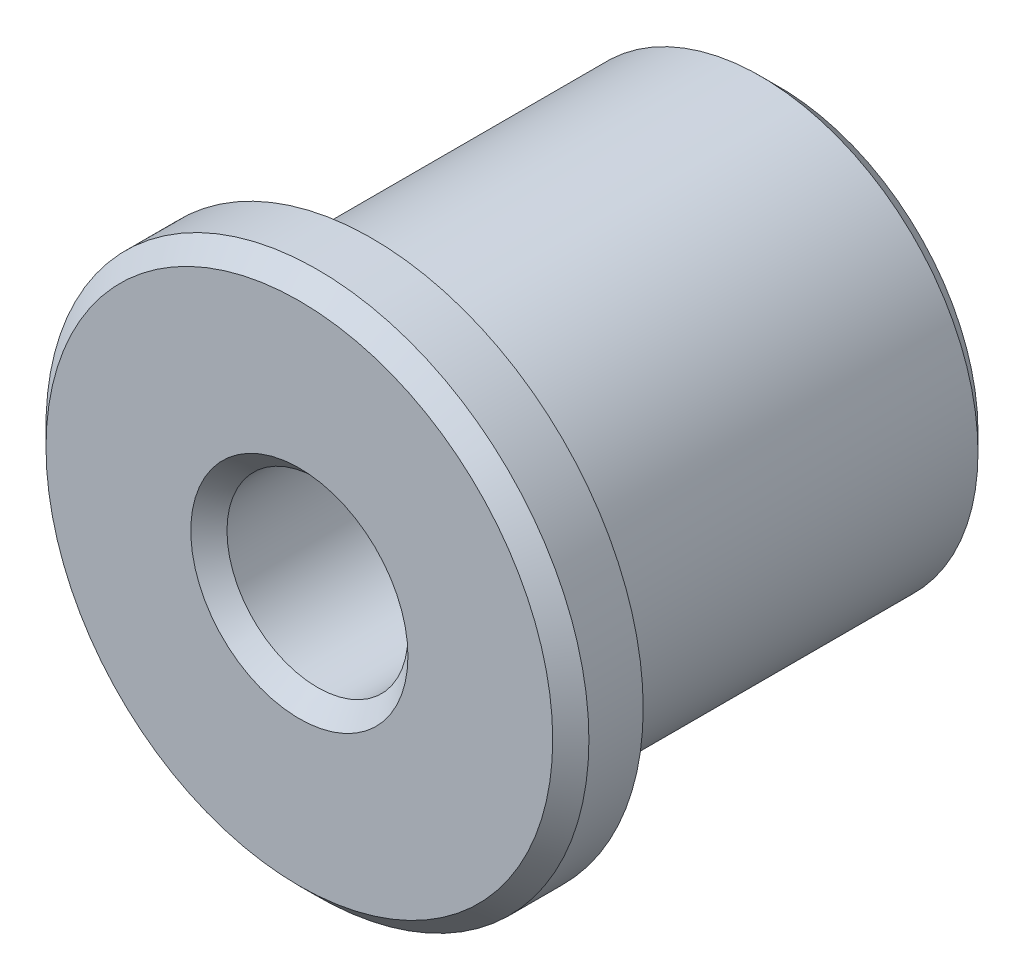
ISO-10303-21;
HEADER;
FILE_DESCRIPTION(('STEP AP214'),'2;1');
FILE_NAME('part.step','',(''),(''),'','','');
FILE_SCHEMA(('AUTOMOTIVE_DESIGN { 1 0 10303 214 1 1 1 1 }'));
ENDSEC;
DATA;
#1=APPLICATION_CONTEXT('core data for automotive mechanical design processes');
#2=APPLICATION_PROTOCOL_DEFINITION('international standard','automotive_design',2000,#1);
#3=PRODUCT_CONTEXT('',#1,'mechanical');
#4=PRODUCT('Part','Part','',(#3));
#5=PRODUCT_RELATED_PRODUCT_CATEGORY('part','',(#4));
#6=PRODUCT_DEFINITION_FORMATION('','',#4);
#7=PRODUCT_DEFINITION_CONTEXT('part definition',#1,'design');
#8=PRODUCT_DEFINITION('design','',#6,#7);
#9=PRODUCT_DEFINITION_SHAPE('','',#8);
#10=(LENGTH_UNIT() NAMED_UNIT(*) SI_UNIT(.MILLI.,.METRE.));
#11=(NAMED_UNIT(*) PLANE_ANGLE_UNIT() SI_UNIT($,.RADIAN.));
#12=(NAMED_UNIT(*) SI_UNIT($,.STERADIAN.) SOLID_ANGLE_UNIT());
#13=UNCERTAINTY_MEASURE_WITH_UNIT(LENGTH_MEASURE(1.E-05),#10,'distance_accuracy_value','');
#14=(GEOMETRIC_REPRESENTATION_CONTEXT(3) GLOBAL_UNCERTAINTY_ASSIGNED_CONTEXT((#13)) GLOBAL_UNIT_ASSIGNED_CONTEXT((#10,
#11,#12)) REPRESENTATION_CONTEXT('',''));
#15=CARTESIAN_POINT('',(0.,0.,0.));
#16=DIRECTION('',(0.,0.,1.));
#17=DIRECTION('',(1.,0.,0.));
#18=AXIS2_PLACEMENT_3D('',#15,#16,#17);
#19=CARTESIAN_POINT('',(0.,0.,0.));
#20=DIRECTION('',(0.,0.,1.));
#21=DIRECTION('',(1.,0.,0.));
#22=AXIS2_PLACEMENT_3D('',#19,#20,#21);
#23=PLANE('',#22);
#24=CARTESIAN_POINT('',(0.,0.,0.));
#25=DIRECTION('',(0.,0.,1.));
#26=DIRECTION('',(1.,0.,0.));
#27=AXIS2_PLACEMENT_3D('',#24,#25,#26);
#28=CIRCLE('',#27,5.99999999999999);
#29=CARTESIAN_POINT('',(5.99999999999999,0.,0.));
#30=VERTEX_POINT('',#29);
#31=EDGE_CURVE('E37',#30,#30,#28,.T.);
#32=ORIENTED_EDGE('',*,*,#31,.T.);
#33=EDGE_LOOP('',(#32));
#34=FACE_BOUND('',#33,.T.);
#35=CARTESIAN_POINT('',(0.,0.,0.));
#36=DIRECTION('',(0.,0.,1.));
#37=DIRECTION('',(1.,0.,0.));
#38=AXIS2_PLACEMENT_3D('',#35,#36,#37);
#39=CIRCLE('',#38,11.);
#40=CARTESIAN_POINT('',(11.,0.,0.));
#41=VERTEX_POINT('',#40);
#42=EDGE_CURVE('E41',#41,#41,#39,.F.);
#43=ORIENTED_EDGE('',*,*,#42,.T.);
#44=EDGE_LOOP('',(#43));
#45=FACE_BOUND('',#44,.T.);
#46=ADVANCED_FACE('F30',(#34,#45),#23,.F.);
#47=CARTESIAN_POINT('',(0.,0.,22.5));
#48=DIRECTION('',(0.,0.,-1.));
#49=DIRECTION('',(-1.,0.,0.));
#50=AXIS2_PLACEMENT_3D('',#47,#48,#49);
#51=CYLINDRICAL_SURFACE('',#50,12.);
#52=CARTESIAN_POINT('',(0.,0.,1.00000000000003));
#53=DIRECTION('',(0.,0.,1.));
#54=DIRECTION('',(1.,0.,0.));
#55=AXIS2_PLACEMENT_3D('',#52,#53,#54);
#56=CIRCLE('',#55,12.);
#57=CARTESIAN_POINT('',(-12.,0.,1.00000000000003));
#58=VERTEX_POINT('',#57);
#59=EDGE_CURVE('E10',#58,#58,#56,.T.);
#60=CARTESIAN_POINT('',(0.,0.,22.5));
#61=DIRECTION('',(0.,0.,1.));
#62=DIRECTION('',(1.,0.,0.));
#63=AXIS2_PLACEMENT_3D('',#60,#61,#62);
#64=CIRCLE('',#63,12.);
#65=CARTESIAN_POINT('',(-12.,0.,22.5));
#66=VERTEX_POINT('',#65);
#67=EDGE_CURVE('E62',#66,#66,#64,.T.);
#68=CARTESIAN_POINT('',(-12.,0.,1.00000000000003));
#69=CARTESIAN_POINT('',(-12.,0.,1.22395833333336));
#70=CARTESIAN_POINT('',(-12.,0.,1.44791666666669));
#71=CARTESIAN_POINT('',(-12.,0.,1.89583333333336));
#72=CARTESIAN_POINT('',(-12.,0.,2.11979166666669));
#73=CARTESIAN_POINT('',(-12.,0.,2.56770833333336));
#74=CARTESIAN_POINT('',(-12.,0.,2.79166666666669));
#75=CARTESIAN_POINT('',(-12.,0.,3.23958333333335));
#76=CARTESIAN_POINT('',(-12.,0.,3.46354166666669));
#77=CARTESIAN_POINT('',(-12.,0.,3.91145833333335));
#78=CARTESIAN_POINT('',(-12.,0.,4.13541666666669));
#79=CARTESIAN_POINT('',(-12.,0.,4.58333333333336));
#80=CARTESIAN_POINT('',(-12.,0.,4.80729166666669));
#81=CARTESIAN_POINT('',(-12.,0.,5.25520833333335));
#82=CARTESIAN_POINT('',(-12.,0.,5.47916666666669));
#83=CARTESIAN_POINT('',(-12.,0.,5.92708333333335));
#84=CARTESIAN_POINT('',(-12.,0.,6.15104166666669));
#85=CARTESIAN_POINT('',(-12.,0.,6.59895833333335));
#86=CARTESIAN_POINT('',(-12.,0.,6.82291666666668));
#87=CARTESIAN_POINT('',(-12.,0.,7.27083333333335));
#88=CARTESIAN_POINT('',(-12.,0.,7.49479166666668));
#89=CARTESIAN_POINT('',(-12.,0.,7.94270833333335));
#90=CARTESIAN_POINT('',(-12.,0.,8.16666666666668));
#91=CARTESIAN_POINT('',(-12.,0.,8.61458333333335));
#92=CARTESIAN_POINT('',(-12.,0.,8.83854166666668));
#93=CARTESIAN_POINT('',(-12.,0.,9.28645833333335));
#94=CARTESIAN_POINT('',(-12.,0.,9.51041666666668));
#95=CARTESIAN_POINT('',(-12.,0.,9.95833333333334));
#96=CARTESIAN_POINT('',(-12.,0.,10.1822916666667));
#97=CARTESIAN_POINT('',(-12.,0.,10.6302083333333));
#98=CARTESIAN_POINT('',(-12.,0.,10.8541666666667));
#99=CARTESIAN_POINT('',(-12.,0.,11.3020833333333));
#100=CARTESIAN_POINT('',(-12.,0.,11.5260416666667));
#101=CARTESIAN_POINT('',(-12.,0.,11.9739583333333));
#102=CARTESIAN_POINT('',(-12.,0.,12.1979166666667));
#103=CARTESIAN_POINT('',(-12.,0.,12.6458333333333));
#104=CARTESIAN_POINT('',(-12.,0.,12.8697916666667));
#105=CARTESIAN_POINT('',(-12.,0.,13.3177083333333));
#106=CARTESIAN_POINT('',(-12.,0.,13.5416666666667));
#107=CARTESIAN_POINT('',(-12.,0.,13.9895833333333));
#108=CARTESIAN_POINT('',(-12.,0.,14.2135416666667));
#109=CARTESIAN_POINT('',(-12.,0.,14.6614583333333));
#110=CARTESIAN_POINT('',(-12.,0.,14.8854166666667));
#111=CARTESIAN_POINT('',(-12.,0.,15.3333333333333));
#112=CARTESIAN_POINT('',(-12.,0.,15.5572916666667));
#113=CARTESIAN_POINT('',(-12.,0.,16.0052083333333));
#114=CARTESIAN_POINT('',(-12.,0.,16.2291666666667));
#115=CARTESIAN_POINT('',(-12.,0.,16.6770833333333));
#116=CARTESIAN_POINT('',(-12.,0.,16.9010416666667));
#117=CARTESIAN_POINT('',(-12.,0.,17.3489583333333));
#118=CARTESIAN_POINT('',(-12.,0.,17.5729166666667));
#119=CARTESIAN_POINT('',(-12.,0.,18.0208333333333));
#120=CARTESIAN_POINT('',(-12.,0.,18.2447916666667));
#121=CARTESIAN_POINT('',(-12.,0.,18.6927083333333));
#122=CARTESIAN_POINT('',(-12.,0.,18.9166666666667));
#123=CARTESIAN_POINT('',(-12.,0.,19.3645833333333));
#124=CARTESIAN_POINT('',(-12.,0.,19.5885416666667));
#125=CARTESIAN_POINT('',(-12.,0.,20.0364583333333));
#126=CARTESIAN_POINT('',(-12.,0.,20.2604166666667));
#127=CARTESIAN_POINT('',(-12.,0.,20.7083333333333));
#128=CARTESIAN_POINT('',(-12.,0.,20.9322916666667));
#129=CARTESIAN_POINT('',(-12.,0.,21.3802083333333));
#130=CARTESIAN_POINT('',(-12.,0.,21.6041666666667));
#131=CARTESIAN_POINT('',(-12.,0.,22.0520833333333));
#132=CARTESIAN_POINT('',(-12.,0.,22.2760416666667));
#133=CARTESIAN_POINT('',(-12.,0.,22.5));
#134=B_SPLINE_CURVE_WITH_KNOTS('',3,(#68,#69,#70,#71,#72,#73,#74,#75,#76,#77,#78,#79,#80,#81,
#82,#83,#84,#85,#86,#87,#88,#89,#90,#91,#92,#93,#94,#95,#96,#97,#98,#99,#100,#101,#102,#103,
#104,#105,#106,#107,#108,#109,#110,#111,#112,#113,#114,#115,#116,#117,#118,#119,#120,#121,#122,
#123,#124,#125,#126,#127,#128,#129,#130,#131,#132,#133),.UNSPECIFIED.,.F.,.F.,(4,2,2,2,2,2,2,2,
2,2,2,2,2,2,2,2,2,2,2,2,2,2,2,2,2,2,2,2,2,2,2,2,4),(0.,0.671874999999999,1.34375,2.015625,
2.6875,3.359375,4.03124999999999,4.703125,5.37499999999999,6.04687499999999,6.71874999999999,
7.39062499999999,8.06249999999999,8.73437499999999,9.40624999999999,10.078125,10.75,11.421875,
12.09375,12.765625,13.4375,14.109375,14.78125,15.453125,16.125,16.796875,17.46875,18.140625,
18.8125,19.484375,20.15625,20.828125,21.5),.UNSPECIFIED.);
#135=EDGE_CURVE('BSEAM79',#58,#66,#134,.T.);
#136=ORIENTED_EDGE('',*,*,#59,.T.);
#137=ORIENTED_EDGE('',*,*,#67,.F.);
#138=ORIENTED_EDGE('',*,*,#135,.T.);
#139=ORIENTED_EDGE('',*,*,#135,.F.);
#140=EDGE_LOOP('',(#136,#138,#137,#139));
#141=FACE_BOUND('',#140,.T.);
#142=ADVANCED_FACE('F79',(#141),#51,.T.);
#143=CARTESIAN_POINT('',(0.,0.,22.5));
#144=DIRECTION('',(0.,0.,-1.));
#145=DIRECTION('',(-1.,0.,0.));
#146=AXIS2_PLACEMENT_3D('',#143,#144,#145);
#147=CYLINDRICAL_SURFACE('',#146,5.);
#148=CARTESIAN_POINT('',(0.,0.,25.5));
#149=DIRECTION('',(0.,0.,1.));
#150=DIRECTION('',(1.,0.,0.));
#151=AXIS2_PLACEMENT_3D('',#148,#149,#150);
#152=CIRCLE('',#151,5.);
#153=CARTESIAN_POINT('',(-5.,0.,25.5));
#154=VERTEX_POINT('',#153);
#155=EDGE_CURVE('E56',#154,#154,#152,.T.);
#156=CARTESIAN_POINT('',(0.,0.,0.999999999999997));
#157=DIRECTION('',(0.,0.,1.));
#158=DIRECTION('',(1.,0.,0.));
#159=AXIS2_PLACEMENT_3D('',#156,#157,#158);
#160=CIRCLE('',#159,5.);
#161=CARTESIAN_POINT('',(-5.,0.,0.999999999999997));
#162=VERTEX_POINT('',#161);
#163=EDGE_CURVE('E59',#162,#162,#160,.F.);
#164=CARTESIAN_POINT('',(-5.,0.,25.5));
#165=CARTESIAN_POINT('',(-5.,0.,25.2447916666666));
#166=CARTESIAN_POINT('',(-5.,0.,24.9895833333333));
#167=CARTESIAN_POINT('',(-5.,0.,24.4791666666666));
#168=CARTESIAN_POINT('',(-5.,0.,24.2239583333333));
#169=CARTESIAN_POINT('',(-5.,0.,23.7135416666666));
#170=CARTESIAN_POINT('',(-5.,0.,23.4583333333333));
#171=CARTESIAN_POINT('',(-5.,0.,22.9479166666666));
#172=CARTESIAN_POINT('',(-5.,0.,22.6927083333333));
#173=CARTESIAN_POINT('',(-5.,0.,22.1822916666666));
#174=CARTESIAN_POINT('',(-5.,0.,21.9270833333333));
#175=CARTESIAN_POINT('',(-5.,0.,21.4166666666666));
#176=CARTESIAN_POINT('',(-5.,0.,21.1614583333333));
#177=CARTESIAN_POINT('',(-5.,0.,20.6510416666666));
#178=CARTESIAN_POINT('',(-5.,0.,20.3958333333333));
#179=CARTESIAN_POINT('',(-5.,0.,19.8854166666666));
#180=CARTESIAN_POINT('',(-5.,0.,19.6302083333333));
#181=CARTESIAN_POINT('',(-5.,0.,19.1197916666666));
#182=CARTESIAN_POINT('',(-5.,0.,18.8645833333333));
#183=CARTESIAN_POINT('',(-5.,0.,18.3541666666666));
#184=CARTESIAN_POINT('',(-5.,0.,18.0989583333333));
#185=CARTESIAN_POINT('',(-5.,0.,17.5885416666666));
#186=CARTESIAN_POINT('',(-5.,0.,17.3333333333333));
#187=CARTESIAN_POINT('',(-5.,0.,16.8229166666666));
#188=CARTESIAN_POINT('',(-5.,0.,16.5677083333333));
#189=CARTESIAN_POINT('',(-5.,0.,16.0572916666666));
#190=CARTESIAN_POINT('',(-5.,0.,15.8020833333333));
#191=CARTESIAN_POINT('',(-5.,0.,15.2916666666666));
#192=CARTESIAN_POINT('',(-5.,0.,15.0364583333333));
#193=CARTESIAN_POINT('',(-5.,0.,14.5260416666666));
#194=CARTESIAN_POINT('',(-5.,0.,14.2708333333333));
#195=CARTESIAN_POINT('',(-5.,0.,13.7604166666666));
#196=CARTESIAN_POINT('',(-5.,0.,13.5052083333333));
#197=CARTESIAN_POINT('',(-5.,0.,12.9947916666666));
#198=CARTESIAN_POINT('',(-5.,0.,12.7395833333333));
#199=CARTESIAN_POINT('',(-5.,0.,12.2291666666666));
#200=CARTESIAN_POINT('',(-5.,0.,11.9739583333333));
#201=CARTESIAN_POINT('',(-5.,0.,11.4635416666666));
#202=CARTESIAN_POINT('',(-5.,0.,11.2083333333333));
#203=CARTESIAN_POINT('',(-5.,0.,10.6979166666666));
#204=CARTESIAN_POINT('',(-5.,0.,10.4427083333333));
#205=CARTESIAN_POINT('',(-5.,0.,9.93229166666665));
#206=CARTESIAN_POINT('',(-5.,0.,9.67708333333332));
#207=CARTESIAN_POINT('',(-5.,0.,9.16666666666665));
#208=CARTESIAN_POINT('',(-5.,0.,8.91145833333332));
#209=CARTESIAN_POINT('',(-5.,0.,8.40104166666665));
#210=CARTESIAN_POINT('',(-5.,0.,8.14583333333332));
#211=CARTESIAN_POINT('',(-5.,0.,7.63541666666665));
#212=CARTESIAN_POINT('',(-5.,0.,7.38020833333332));
#213=CARTESIAN_POINT('',(-5.,0.,6.86979166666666));
#214=CARTESIAN_POINT('',(-5.,0.,6.61458333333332));
#215=CARTESIAN_POINT('',(-5.,0.,6.10416666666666));
#216=CARTESIAN_POINT('',(-5.,0.,5.84895833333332));
#217=CARTESIAN_POINT('',(-5.,0.,5.33854166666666));
#218=CARTESIAN_POINT('',(-5.,0.,5.08333333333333));
#219=CARTESIAN_POINT('',(-5.,0.,4.57291666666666));
#220=CARTESIAN_POINT('',(-5.,0.,4.31770833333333));
#221=CARTESIAN_POINT('',(-5.,0.,3.80729166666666));
#222=CARTESIAN_POINT('',(-5.,0.,3.55208333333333));
#223=CARTESIAN_POINT('',(-5.,0.,3.04166666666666));
#224=CARTESIAN_POINT('',(-5.,0.,2.78645833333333));
#225=CARTESIAN_POINT('',(-5.,0.,2.27604166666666));
#226=CARTESIAN_POINT('',(-5.,0.,2.02083333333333));
#227=CARTESIAN_POINT('',(-5.,0.,1.51041666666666));
#228=CARTESIAN_POINT('',(-5.,0.,1.25520833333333));
#229=CARTESIAN_POINT('',(-5.,0.,0.999999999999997));
#230=B_SPLINE_CURVE_WITH_KNOTS('',3,(#164,#165,#166,#167,#168,#169,#170,#171,#172,#173,#174,
#175,#176,#177,#178,#179,#180,#181,#182,#183,#184,#185,#186,#187,#188,#189,#190,#191,#192,#193,
#194,#195,#196,#197,#198,#199,#200,#201,#202,#203,#204,#205,#206,#207,#208,#209,#210,#211,#212,
#213,#214,#215,#216,#217,#218,#219,#220,#221,#222,#223,#224,#225,#226,#227,#228,#229),
.UNSPECIFIED.,.F.,.F.,(4,2,2,2,2,2,2,2,2,2,2,2,2,2,2,2,2,2,2,2,2,2,2,2,2,2,2,2,2,2,2,2,4),(0.,
0.765624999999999,1.53125,2.296875,3.0625,3.82812499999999,4.59374999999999,5.35937499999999,
6.12499999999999,6.89062499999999,7.65624999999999,8.42187499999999,9.18749999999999,
9.95312499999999,10.71875,11.484375,12.25,13.015625,13.78125,14.546875,15.3125,16.078125,
16.84375,17.609375,18.375,19.140625,19.90625,20.671875,21.4375,22.203125,22.96875,23.734375,
24.5),.UNSPECIFIED.);
#231=EDGE_CURVE('BSEAM75',#154,#162,#230,.T.);
#232=ORIENTED_EDGE('',*,*,#155,.T.);
#233=ORIENTED_EDGE('',*,*,#163,.T.);
#234=ORIENTED_EDGE('',*,*,#231,.T.);
#235=ORIENTED_EDGE('',*,*,#231,.F.);
#236=EDGE_LOOP('',(#232,#234,#233,#235));
#237=FACE_BOUND('',#236,.T.);
#238=ADVANCED_FACE('F75',(#237),#147,.F.);
#239=CARTESIAN_POINT('',(0.,0.,22.5));
#240=DIRECTION('',(0.,0.,1.));
#241=DIRECTION('',(1.,0.,0.));
#242=AXIS2_PLACEMENT_3D('',#239,#240,#241);
#243=PLANE('',#242);
#244=CARTESIAN_POINT('',(0.,0.,22.5));
#245=DIRECTION('',(0.,0.,1.));
#246=DIRECTION('',(1.,0.,0.));
#247=AXIS2_PLACEMENT_3D('',#244,#245,#246);
#248=CIRCLE('',#247,15.);
#249=CARTESIAN_POINT('',(15.,0.,22.5));
#250=VERTEX_POINT('',#249);
#251=EDGE_CURVE('E65',#250,#250,#248,.T.);
#252=ORIENTED_EDGE('',*,*,#251,.F.);
#253=EDGE_LOOP('',(#252));
#254=FACE_BOUND('',#253,.T.);
#255=ORIENTED_EDGE('',*,*,#67,.T.);
#256=EDGE_LOOP('',(#255));
#257=FACE_BOUND('',#256,.T.);
#258=ADVANCED_FACE('F71',(#254,#257),#243,.F.);
#259=CARTESIAN_POINT('',(0.,0.,26.5));
#260=DIRECTION('',(0.,0.,1.));
#261=DIRECTION('',(1.,0.,0.));
#262=AXIS2_PLACEMENT_3D('',#259,#260,#261);
#263=PLANE('',#262);
#264=CARTESIAN_POINT('',(0.,0.,26.5));
#265=DIRECTION('',(0.,0.,1.));
#266=DIRECTION('',(1.,0.,0.));
#267=AXIS2_PLACEMENT_3D('',#264,#265,#266);
#268=CIRCLE('',#267,6.00000000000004);
#269=CARTESIAN_POINT('',(6.00000000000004,0.,26.5));
#270=VERTEX_POINT('',#269);
#271=EDGE_CURVE('E50',#270,#270,#268,.F.);
#272=ORIENTED_EDGE('',*,*,#271,.T.);
#273=EDGE_LOOP('',(#272));
#274=FACE_BOUND('',#273,.T.);
#275=CARTESIAN_POINT('',(0.,0.,26.5));
#276=DIRECTION('',(0.,0.,1.));
#277=DIRECTION('',(1.,0.,0.));
#278=AXIS2_PLACEMENT_3D('',#275,#276,#277);
#279=CIRCLE('',#278,14.);
#280=CARTESIAN_POINT('',(14.,0.,26.5));
#281=VERTEX_POINT('',#280);
#282=EDGE_CURVE('E53',#281,#281,#279,.T.);
#283=ORIENTED_EDGE('',*,*,#282,.T.);
#284=EDGE_LOOP('',(#283));
#285=FACE_BOUND('',#284,.T.);
#286=ADVANCED_FACE('F74',(#274,#285),#263,.T.);
#287=CARTESIAN_POINT('',(0.,0.,26.5));
#288=DIRECTION('',(0.,0.,-1.));
#289=DIRECTION('',(-1.,0.,0.));
#290=AXIS2_PLACEMENT_3D('',#287,#288,#289);
#291=CYLINDRICAL_SURFACE('',#290,15.);
#292=CARTESIAN_POINT('',(0.,0.,25.5));
#293=DIRECTION('',(0.,0.,1.));
#294=DIRECTION('',(1.,0.,0.));
#295=AXIS2_PLACEMENT_3D('',#292,#293,#294);
#296=CIRCLE('',#295,15.);
#297=CARTESIAN_POINT('',(15.,0.,25.5));
#298=VERTEX_POINT('',#297);
#299=EDGE_CURVE('E45',#298,#298,#296,.F.);
#300=ORIENTED_EDGE('',*,*,#299,.T.);
#301=EDGE_LOOP('',(#300));
#302=FACE_BOUND('',#301,.T.);
#303=ORIENTED_EDGE('',*,*,#251,.T.);
#304=EDGE_LOOP('',(#303));
#305=FACE_BOUND('',#304,.T.);
#306=ADVANCED_FACE('F69',(#302,#305),#291,.T.);
#307=CARTESIAN_POINT('',(0.,0.,25.5));
#308=DIRECTION('',(0.,0.,1.));
#309=DIRECTION('',(1.,0.,0.));
#310=AXIS2_PLACEMENT_3D('',#307,#308,#309);
#311=CONICAL_SURFACE('',#310,5.,0.78539816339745);
#312=ORIENTED_EDGE('',*,*,#271,.F.);
#313=EDGE_LOOP('',(#312));
#314=FACE_BOUND('',#313,.T.);
#315=ORIENTED_EDGE('',*,*,#155,.F.);
#316=EDGE_LOOP('',(#315));
#317=FACE_BOUND('',#316,.T.);
#318=ADVANCED_FACE('F90',(#314,#317),#311,.F.);
#319=CARTESIAN_POINT('',(0.,0.,26.5));
#320=DIRECTION('',(0.,0.,-1.));
#321=DIRECTION('',(-1.,0.,0.));
#322=AXIS2_PLACEMENT_3D('',#319,#320,#321);
#323=CONICAL_SURFACE('',#322,14.,0.785398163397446);
#324=ORIENTED_EDGE('',*,*,#299,.F.);
#325=EDGE_LOOP('',(#324));
#326=FACE_BOUND('',#325,.T.);
#327=ORIENTED_EDGE('',*,*,#282,.F.);
#328=EDGE_LOOP('',(#327));
#329=FACE_BOUND('',#328,.T.);
#330=ADVANCED_FACE('F93',(#326,#329),#323,.T.);
#331=CARTESIAN_POINT('',(0.,0.,0.));
#332=DIRECTION('',(0.,0.,-1.));
#333=DIRECTION('',(-1.,0.,0.));
#334=AXIS2_PLACEMENT_3D('',#331,#332,#333);
#335=CONICAL_SURFACE('',#334,5.99999999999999,0.785398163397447);
#336=ORIENTED_EDGE('',*,*,#163,.F.);
#337=EDGE_LOOP('',(#336));
#338=FACE_BOUND('',#337,.T.);
#339=ORIENTED_EDGE('',*,*,#31,.F.);
#340=EDGE_LOOP('',(#339));
#341=FACE_BOUND('',#340,.T.);
#342=ADVANCED_FACE('F96',(#338,#341),#335,.F.);
#343=CARTESIAN_POINT('',(0.,0.,1.00000000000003));
#344=DIRECTION('',(0.,0.,1.));
#345=DIRECTION('',(1.,0.,0.));
#346=AXIS2_PLACEMENT_3D('',#343,#344,#345);
#347=CONICAL_SURFACE('',#346,12.,0.785398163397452);
#348=ORIENTED_EDGE('',*,*,#42,.F.);
#349=EDGE_LOOP('',(#348));
#350=FACE_BOUND('',#349,.T.);
#351=ORIENTED_EDGE('',*,*,#59,.F.);
#352=EDGE_LOOP('',(#351));
#353=FACE_BOUND('',#352,.T.);
#354=ADVANCED_FACE('F32',(#350,#353),#347,.T.);
#355=CLOSED_SHELL('',(#46,#142,#238,#258,#286,#306,#318,#330,#342,#354));
#356=MANIFOLD_SOLID_BREP('B2',#355);
#357=ADVANCED_BREP_SHAPE_REPRESENTATION('',(#18,#356),#14);
#358=SHAPE_DEFINITION_REPRESENTATION(#9,#357);
ENDSEC;
END-ISO-10303-21;
